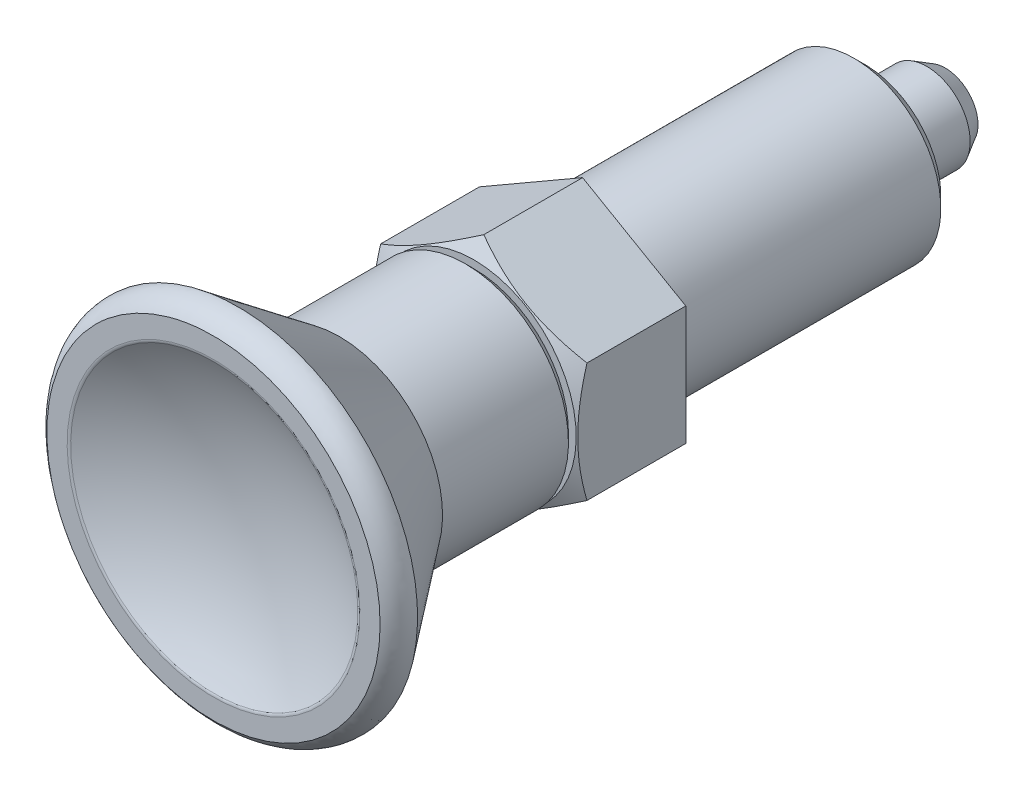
ISO-10303-21;
HEADER;
FILE_DESCRIPTION(('STEP AP214'),'2;1');
FILE_NAME('part.step','',(''),(''),'','','');
FILE_SCHEMA(('AUTOMOTIVE_DESIGN { 1 0 10303 214 1 1 1 1 }'));
ENDSEC;
DATA;
#1=APPLICATION_CONTEXT('core data for automotive mechanical design processes');
#2=APPLICATION_PROTOCOL_DEFINITION('international standard','automotive_design',2000,#1);
#3=PRODUCT_CONTEXT('',#1,'mechanical');
#4=PRODUCT('Part','Part','',(#3));
#5=PRODUCT_RELATED_PRODUCT_CATEGORY('part','',(#4));
#6=PRODUCT_DEFINITION_FORMATION('','',#4);
#7=PRODUCT_DEFINITION_CONTEXT('part definition',#1,'design');
#8=PRODUCT_DEFINITION('design','',#6,#7);
#9=PRODUCT_DEFINITION_SHAPE('','',#8);
#10=(LENGTH_UNIT() NAMED_UNIT(*) SI_UNIT(.MILLI.,.METRE.));
#11=(NAMED_UNIT(*) PLANE_ANGLE_UNIT() SI_UNIT($,.RADIAN.));
#12=(NAMED_UNIT(*) SI_UNIT($,.STERADIAN.) SOLID_ANGLE_UNIT());
#13=UNCERTAINTY_MEASURE_WITH_UNIT(LENGTH_MEASURE(1.E-05),#10,'distance_accuracy_value','');
#14=(GEOMETRIC_REPRESENTATION_CONTEXT(3) GLOBAL_UNCERTAINTY_ASSIGNED_CONTEXT((#13)) GLOBAL_UNIT_ASSIGNED_CONTEXT((#10,
#11,#12)) REPRESENTATION_CONTEXT('',''));
#15=CARTESIAN_POINT('',(0.,0.,0.));
#16=DIRECTION('',(0.,0.,1.));
#17=DIRECTION('',(1.,0.,0.));
#18=AXIS2_PLACEMENT_3D('',#15,#16,#17);
#19=CARTESIAN_POINT('',(0.,0.,-26.));
#20=DIRECTION('',(0.,0.,1.));
#21=DIRECTION('',(0.5,0.866025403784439,0.));
#22=AXIS2_PLACEMENT_3D('',#19,#20,#21);
#23=CONICAL_SURFACE('',#22,7.,0.785398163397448);
#24=CARTESIAN_POINT('',(0.,0.,-25.));
#25=DIRECTION('',(0.,0.,-1.));
#26=DIRECTION('',(0.5,0.866025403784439,0.));
#27=AXIS2_PLACEMENT_3D('',#24,#25,#26);
#28=CIRCLE('',#27,8.);
#29=CARTESIAN_POINT('',(4.00000000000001,6.9282032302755,-25.));
#30=VERTEX_POINT('',#29);
#31=EDGE_CURVE('E117',#30,#30,#28,.T.);
#32=ORIENTED_EDGE('',*,*,#31,.T.);
#33=EDGE_LOOP('',(#32));
#34=FACE_BOUND('',#33,.T.);
#35=CARTESIAN_POINT('',(0.,0.,-26.));
#36=DIRECTION('',(0.,0.,1.));
#37=DIRECTION('',(0.5,0.866025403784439,0.));
#38=AXIS2_PLACEMENT_3D('',#35,#36,#37);
#39=CIRCLE('',#38,7.);
#40=CARTESIAN_POINT('',(3.50000000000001,6.06217782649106,-26.));
#41=VERTEX_POINT('',#40);
#42=EDGE_CURVE('E121',#41,#41,#39,.T.);
#43=ORIENTED_EDGE('',*,*,#42,.T.);
#44=EDGE_LOOP('',(#43));
#45=FACE_BOUND('',#44,.T.);
#46=ADVANCED_FACE('F14',(#34,#45),#23,.T.);
#47=CARTESIAN_POINT('',(0.,0.,0.));
#48=DIRECTION('',(0.,0.,-1.));
#49=DIRECTION('',(0.5,0.866025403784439,0.));
#50=AXIS2_PLACEMENT_3D('',#47,#48,#49);
#51=CYLINDRICAL_SURFACE('',#50,8.);
#52=ORIENTED_EDGE('',*,*,#31,.F.);
#53=EDGE_LOOP('',(#52));
#54=FACE_BOUND('',#53,.T.);
#55=CARTESIAN_POINT('',(0.,0.,0.));
#56=DIRECTION('',(0.,0.,1.));
#57=DIRECTION('',(0.5,0.866025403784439,0.));
#58=AXIS2_PLACEMENT_3D('',#55,#56,#57);
#59=CIRCLE('',#58,8.);
#60=CARTESIAN_POINT('',(4.00000000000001,6.9282032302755,0.));
#61=VERTEX_POINT('',#60);
#62=EDGE_CURVE('E111',#61,#61,#59,.T.);
#63=ORIENTED_EDGE('',*,*,#62,.F.);
#64=EDGE_LOOP('',(#63));
#65=FACE_BOUND('',#64,.T.);
#66=ADVANCED_FACE('F178',(#54,#65),#51,.T.);
#67=CARTESIAN_POINT('',(-4.63022135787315,17.2802213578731,0.));
#68=DIRECTION('',(0.,0.,-1.));
#69=DIRECTION('',(0.866025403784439,-0.5,0.));
#70=AXIS2_PLACEMENT_3D('',#67,#68,#69);
#71=PLANE('',#70);
#72=DIRECTION('',(-0.866025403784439,0.5,0.));
#73=VECTOR('',#72,1.);
#74=CARTESIAN_POINT('',(0.,-10.9725,0.));
#75=LINE('',#74,#73);
#76=CARTESIAN_POINT('',(0.,-10.9725,0.));
#77=VERTEX_POINT('',#76);
#78=CARTESIAN_POINT('',(-9.50246374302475,-5.48625,0.));
#79=VERTEX_POINT('',#78);
#80=EDGE_CURVE('E312',#77,#79,#75,.T.);
#81=ORIENTED_EDGE('',*,*,#80,.T.);
#82=DIRECTION('',(0.,1.,0.));
#83=VECTOR('',#82,1.);
#84=CARTESIAN_POINT('',(-9.50246374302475,-5.48625,0.));
#85=LINE('',#84,#83);
#86=CARTESIAN_POINT('',(-9.50246374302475,5.48625,0.));
#87=VERTEX_POINT('',#86);
#88=EDGE_CURVE('E318',#79,#87,#85,.T.);
#89=ORIENTED_EDGE('',*,*,#88,.T.);
#90=DIRECTION('',(0.866025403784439,0.5,0.));
#91=VECTOR('',#90,1.);
#92=CARTESIAN_POINT('',(-9.50246374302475,5.48625,0.));
#93=LINE('',#92,#91);
#94=CARTESIAN_POINT('',(0.,10.9725,0.));
#95=VERTEX_POINT('',#94);
#96=EDGE_CURVE('E81',#87,#95,#93,.T.);
#97=ORIENTED_EDGE('',*,*,#96,.T.);
#98=DIRECTION('',(0.866025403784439,-0.5,0.));
#99=VECTOR('',#98,1.);
#100=CARTESIAN_POINT('',(0.,10.9725,0.));
#101=LINE('',#100,#99);
#102=CARTESIAN_POINT('',(9.50246374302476,5.48625,0.));
#103=VERTEX_POINT('',#102);
#104=EDGE_CURVE('E86',#95,#103,#101,.T.);
#105=ORIENTED_EDGE('',*,*,#104,.T.);
#106=DIRECTION('',(0.,-1.,0.));
#107=VECTOR('',#106,1.);
#108=CARTESIAN_POINT('',(9.50246374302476,5.48625,0.));
#109=LINE('',#108,#107);
#110=CARTESIAN_POINT('',(9.50246374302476,-5.48625,0.));
#111=VERTEX_POINT('',#110);
#112=EDGE_CURVE('E90',#103,#111,#109,.T.);
#113=ORIENTED_EDGE('',*,*,#112,.T.);
#114=DIRECTION('',(-0.866025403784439,-0.5,0.));
#115=VECTOR('',#114,1.);
#116=CARTESIAN_POINT('',(9.50246374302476,-5.48625,0.));
#117=LINE('',#116,#115);
#118=EDGE_CURVE('E106',#111,#77,#117,.T.);
#119=ORIENTED_EDGE('',*,*,#118,.T.);
#120=EDGE_LOOP('',(#81,#89,#97,#105,#113,#119));
#121=FACE_BOUND('',#120,.T.);
#122=ORIENTED_EDGE('',*,*,#62,.T.);
#123=EDGE_LOOP('',(#122));
#124=FACE_BOUND('',#123,.T.);
#125=ADVANCED_FACE('F87',(#121,#124),#71,.T.);
#126=CARTESIAN_POINT('',(-9.50246374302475,-5.48625,10.));
#127=DIRECTION('',(0.5,0.866025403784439,0.));
#128=DIRECTION('',(0.866025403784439,-0.5,0.));
#129=AXIS2_PLACEMENT_3D('',#126,#127,#128);
#130=PLANE('',#129);
#131=DIRECTION('',(0.,0.,-1.));
#132=VECTOR('',#131,1.);
#133=CARTESIAN_POINT('',(-9.50246374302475,-5.48625,9.1));
#134=LINE('',#133,#132);
#135=CARTESIAN_POINT('',(-9.50246374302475,-5.48625,9.1));
#136=VERTEX_POINT('',#135);
#137=EDGE_CURVE('E301',#136,#79,#134,.T.);
#138=ORIENTED_EDGE('',*,*,#137,.T.);
#139=ORIENTED_EDGE('',*,*,#80,.F.);
#140=DIRECTION('',(0.,0.,1.));
#141=VECTOR('',#140,1.);
#142=CARTESIAN_POINT('',(0.,-10.9725,0.));
#143=LINE('',#142,#141);
#144=CARTESIAN_POINT('',(0.,-10.9725,9.1));
#145=VERTEX_POINT('',#144);
#146=EDGE_CURVE('E302',#77,#145,#143,.T.);
#147=ORIENTED_EDGE('',*,*,#146,.T.);
#148=CARTESIAN_POINT('',(-9.50246374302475,-5.48625,9.1));
#149=CARTESIAN_POINT('',(-4.75123187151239,-8.22937500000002,10.6837439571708));
#150=CARTESIAN_POINT('',(0.,-10.9725,9.1));
#151=(BOUNDED_CURVE() B_SPLINE_CURVE(2,(#148,#149,#150),.UNSPECIFIED.,.F.,
.F.) B_SPLINE_CURVE_WITH_KNOTS((3,3),(0.,1.),
.UNSPECIFIED.) CURVE() GEOMETRIC_REPRESENTATION_ITEM() RATIONAL_B_SPLINE_CURVE((1.,
1.15470053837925,1.)) REPRESENTATION_ITEM(''));
#152=EDGE_CURVE('E283',#136,#145,#151,.T.);
#153=ORIENTED_EDGE('',*,*,#152,.F.);
#154=EDGE_LOOP('',(#138,#139,#147,#153));
#155=FACE_BOUND('',#154,.T.);
#156=ADVANCED_FACE('F401',(#155),#130,.F.);
#157=CARTESIAN_POINT('',(-9.50246374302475,5.48625,10.));
#158=DIRECTION('',(1.,0.,0.));
#159=DIRECTION('',(0.,-1.,0.));
#160=AXIS2_PLACEMENT_3D('',#157,#158,#159);
#161=PLANE('',#160);
#162=DIRECTION('',(0.,0.,-1.));
#163=VECTOR('',#162,1.);
#164=CARTESIAN_POINT('',(-9.50246374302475,5.48625,9.1));
#165=LINE('',#164,#163);
#166=CARTESIAN_POINT('',(-9.50246374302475,5.48625,9.1));
#167=VERTEX_POINT('',#166);
#168=EDGE_CURVE('E308',#167,#87,#165,.T.);
#169=ORIENTED_EDGE('',*,*,#168,.T.);
#170=ORIENTED_EDGE('',*,*,#88,.F.);
#171=ORIENTED_EDGE('',*,*,#137,.F.);
#172=CARTESIAN_POINT('',(-9.50246374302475,5.48625,9.1));
#173=CARTESIAN_POINT('',(-9.50246374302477,0.,10.6837439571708));
#174=CARTESIAN_POINT('',(-9.50246374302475,-5.48625,9.1));
#175=(BOUNDED_CURVE() B_SPLINE_CURVE(2,(#172,#173,#174),.UNSPECIFIED.,.F.,
.F.) B_SPLINE_CURVE_WITH_KNOTS((3,3),(0.,1.),
.UNSPECIFIED.) CURVE() GEOMETRIC_REPRESENTATION_ITEM() RATIONAL_B_SPLINE_CURVE((1.,
1.15470053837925,1.)) REPRESENTATION_ITEM(''));
#176=EDGE_CURVE('E274',#167,#136,#175,.T.);
#177=ORIENTED_EDGE('',*,*,#176,.F.);
#178=EDGE_LOOP('',(#169,#170,#171,#177));
#179=FACE_BOUND('',#178,.T.);
#180=ADVANCED_FACE('F413',(#179),#161,.F.);
#181=CARTESIAN_POINT('',(0.,10.9725,10.));
#182=DIRECTION('',(0.5,-0.866025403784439,0.));
#183=DIRECTION('',(-0.866025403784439,-0.5,0.));
#184=AXIS2_PLACEMENT_3D('',#181,#182,#183);
#185=PLANE('',#184);
#186=DIRECTION('',(0.,0.,-1.));
#187=VECTOR('',#186,1.);
#188=CARTESIAN_POINT('',(0.,10.9725,9.1));
#189=LINE('',#188,#187);
#190=CARTESIAN_POINT('',(0.,10.9725,9.1));
#191=VERTEX_POINT('',#190);
#192=EDGE_CURVE('E99',#191,#95,#189,.T.);
#193=ORIENTED_EDGE('',*,*,#192,.T.);
#194=ORIENTED_EDGE('',*,*,#96,.F.);
#195=ORIENTED_EDGE('',*,*,#168,.F.);
#196=CARTESIAN_POINT('',(0.,10.9725,9.1));
#197=CARTESIAN_POINT('',(-4.75123187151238,8.229375,10.6837439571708));
#198=CARTESIAN_POINT('',(-9.50246374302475,5.48625,9.1));
#199=(BOUNDED_CURVE() B_SPLINE_CURVE(2,(#196,#197,#198),.UNSPECIFIED.,.F.,
.F.) B_SPLINE_CURVE_WITH_KNOTS((3,3),(0.,1.),
.UNSPECIFIED.) CURVE() GEOMETRIC_REPRESENTATION_ITEM() RATIONAL_B_SPLINE_CURVE((1.,
1.15470053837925,1.)) REPRESENTATION_ITEM(''));
#200=EDGE_CURVE('E265',#191,#167,#199,.T.);
#201=ORIENTED_EDGE('',*,*,#200,.F.);
#202=EDGE_LOOP('',(#193,#194,#195,#201));
#203=FACE_BOUND('',#202,.T.);
#204=ADVANCED_FACE('F425',(#203),#185,.F.);
#205=CARTESIAN_POINT('',(9.50246374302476,5.48625,10.));
#206=DIRECTION('',(-0.5,-0.866025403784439,0.));
#207=DIRECTION('',(-0.866025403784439,0.5,0.));
#208=AXIS2_PLACEMENT_3D('',#205,#206,#207);
#209=PLANE('',#208);
#210=DIRECTION('',(0.,0.,-1.));
#211=VECTOR('',#210,1.);
#212=CARTESIAN_POINT('',(9.50246374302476,5.48625,9.1));
#213=LINE('',#212,#211);
#214=CARTESIAN_POINT('',(9.50246374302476,5.48625,9.1));
#215=VERTEX_POINT('',#214);
#216=EDGE_CURVE('E94',#215,#103,#213,.T.);
#217=ORIENTED_EDGE('',*,*,#216,.T.);
#218=ORIENTED_EDGE('',*,*,#104,.F.);
#219=ORIENTED_EDGE('',*,*,#192,.F.);
#220=CARTESIAN_POINT('',(9.50246374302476,5.48625,9.1));
#221=CARTESIAN_POINT('',(4.75123187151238,8.22937500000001,10.6837439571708));
#222=CARTESIAN_POINT('',(0.,10.9725,9.1));
#223=(BOUNDED_CURVE() B_SPLINE_CURVE(2,(#220,#221,#222),.UNSPECIFIED.,.F.,
.F.) B_SPLINE_CURVE_WITH_KNOTS((3,3),(0.,1.),
.UNSPECIFIED.) CURVE() GEOMETRIC_REPRESENTATION_ITEM() RATIONAL_B_SPLINE_CURVE((1.,
1.15470053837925,1.)) REPRESENTATION_ITEM(''));
#224=EDGE_CURVE('E39',#215,#191,#223,.T.);
#225=ORIENTED_EDGE('',*,*,#224,.F.);
#226=EDGE_LOOP('',(#217,#218,#219,#225));
#227=FACE_BOUND('',#226,.T.);
#228=ADVANCED_FACE('F95',(#227),#209,.F.);
#229=CARTESIAN_POINT('',(9.50246374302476,-5.48625,10.));
#230=DIRECTION('',(-1.,0.,0.));
#231=DIRECTION('',(0.,1.,0.));
#232=AXIS2_PLACEMENT_3D('',#229,#230,#231);
#233=PLANE('',#232);
#234=DIRECTION('',(0.,0.,-1.));
#235=VECTOR('',#234,1.);
#236=CARTESIAN_POINT('',(9.50246374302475,-5.48625,9.1));
#237=LINE('',#236,#235);
#238=CARTESIAN_POINT('',(9.50246374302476,-5.48625,9.1));
#239=VERTEX_POINT('',#238);
#240=EDGE_CURVE('E100',#239,#111,#237,.T.);
#241=ORIENTED_EDGE('',*,*,#240,.T.);
#242=ORIENTED_EDGE('',*,*,#112,.F.);
#243=ORIENTED_EDGE('',*,*,#216,.F.);
#244=CARTESIAN_POINT('',(9.50246374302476,-5.48625,9.1));
#245=CARTESIAN_POINT('',(9.50246374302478,0.,10.6837439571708));
#246=CARTESIAN_POINT('',(9.50246374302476,5.48625,9.1));
#247=(BOUNDED_CURVE() B_SPLINE_CURVE(2,(#244,#245,#246),.UNSPECIFIED.,.F.,
.F.) B_SPLINE_CURVE_WITH_KNOTS((3,3),(0.,1.),
.UNSPECIFIED.) CURVE() GEOMETRIC_REPRESENTATION_ITEM() RATIONAL_B_SPLINE_CURVE((1.,
1.15470053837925,1.)) REPRESENTATION_ITEM(''));
#248=EDGE_CURVE('E253',#239,#215,#247,.T.);
#249=ORIENTED_EDGE('',*,*,#248,.F.);
#250=EDGE_LOOP('',(#241,#242,#243,#249));
#251=FACE_BOUND('',#250,.T.);
#252=ADVANCED_FACE('F103',(#251),#233,.F.);
#253=CARTESIAN_POINT('',(0.,-10.9725,10.));
#254=DIRECTION('',(-0.5,0.866025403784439,0.));
#255=DIRECTION('',(0.866025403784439,0.5,0.));
#256=AXIS2_PLACEMENT_3D('',#253,#254,#255);
#257=PLANE('',#256);
#258=ORIENTED_EDGE('',*,*,#146,.F.);
#259=ORIENTED_EDGE('',*,*,#118,.F.);
#260=ORIENTED_EDGE('',*,*,#240,.F.);
#261=CARTESIAN_POINT('',(0.,-10.9725,9.1));
#262=CARTESIAN_POINT('',(4.75123187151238,-8.229375,10.6837439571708));
#263=CARTESIAN_POINT('',(9.50246374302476,-5.48625,9.1));
#264=(BOUNDED_CURVE() B_SPLINE_CURVE(2,(#261,#262,#263),.UNSPECIFIED.,.F.,
.F.) B_SPLINE_CURVE_WITH_KNOTS((3,3),(0.,1.),
.UNSPECIFIED.) CURVE() GEOMETRIC_REPRESENTATION_ITEM() RATIONAL_B_SPLINE_CURVE((1.,
1.15470053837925,1.)) REPRESENTATION_ITEM(''));
#265=EDGE_CURVE('E292',#145,#239,#264,.T.);
#266=ORIENTED_EDGE('',*,*,#265,.F.);
#267=EDGE_LOOP('',(#258,#259,#260,#266));
#268=FACE_BOUND('',#267,.T.);
#269=ADVANCED_FACE('F402',(#268),#257,.F.);
#270=CARTESIAN_POINT('',(0.,0.,10.));
#271=DIRECTION('',(0.,0.,-1.));
#272=DIRECTION('',(0.866025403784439,-0.5,0.));
#273=AXIS2_PLACEMENT_3D('',#270,#271,#272);
#274=CONICAL_SURFACE('',#273,9.41365427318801,1.0471975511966);
#275=ORIENTED_EDGE('',*,*,#248,.T.);
#276=ORIENTED_EDGE('',*,*,#224,.T.);
#277=ORIENTED_EDGE('',*,*,#200,.T.);
#278=ORIENTED_EDGE('',*,*,#176,.T.);
#279=ORIENTED_EDGE('',*,*,#152,.T.);
#280=ORIENTED_EDGE('',*,*,#265,.T.);
#281=EDGE_LOOP('',(#275,#276,#277,#278,#279,#280));
#282=FACE_BOUND('',#281,.T.);
#283=CARTESIAN_POINT('',(0.,0.,10.));
#284=DIRECTION('',(0.,0.,1.));
#285=DIRECTION('',(0.866025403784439,-0.5,0.));
#286=AXIS2_PLACEMENT_3D('',#283,#284,#285);
#287=CIRCLE('',#286,9.41365427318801);
#288=CARTESIAN_POINT('',(8.15246374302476,-4.70682713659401,10.));
#289=VERTEX_POINT('',#288);
#290=EDGE_CURVE('E128',#289,#289,#287,.T.);
#291=ORIENTED_EDGE('',*,*,#290,.F.);
#292=EDGE_LOOP('',(#291));
#293=FACE_BOUND('',#292,.T.);
#294=ADVANCED_FACE('F459',(#282,#293),#274,.T.);
#295=CARTESIAN_POINT('',(-17.2802213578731,-4.63022135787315,10.));
#296=DIRECTION('',(0.,0.,1.));
#297=DIRECTION('',(0.866025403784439,-0.5,0.));
#298=AXIS2_PLACEMENT_3D('',#295,#296,#297);
#299=PLANE('',#298);
#300=CARTESIAN_POINT('',(0.,0.,10.));
#301=DIRECTION('',(0.,0.,1.));
#302=DIRECTION('',(-0.5,-0.866025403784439,0.));
#303=AXIS2_PLACEMENT_3D('',#300,#301,#302);
#304=CIRCLE('',#303,8.7);
#305=CARTESIAN_POINT('',(-4.34999999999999,-7.53442101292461,10.));
#306=VERTEX_POINT('',#305);
#307=EDGE_CURVE('E126',#306,#306,#304,.T.);
#308=ORIENTED_EDGE('',*,*,#307,.F.);
#309=EDGE_LOOP('',(#308));
#310=FACE_BOUND('',#309,.T.);
#311=ORIENTED_EDGE('',*,*,#290,.T.);
#312=EDGE_LOOP('',(#311));
#313=FACE_BOUND('',#312,.T.);
#314=ADVANCED_FACE('F479',(#310,#313),#299,.T.);
#315=CARTESIAN_POINT('',(0.,0.,10.));
#316=DIRECTION('',(0.,0.,1.));
#317=DIRECTION('',(0.866025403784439,-0.5,0.));
#318=AXIS2_PLACEMENT_3D('',#315,#316,#317);
#319=CONICAL_SURFACE('',#318,8.7,0.785398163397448);
#320=CARTESIAN_POINT('',(0.,0.,10.8));
#321=DIRECTION('',(0.,0.,1.));
#322=DIRECTION('',(0.866025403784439,-0.5,0.));
#323=AXIS2_PLACEMENT_3D('',#320,#321,#322);
#324=CIRCLE('',#323,9.5);
#325=CARTESIAN_POINT('',(8.22724133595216,-4.75,10.8));
#326=VERTEX_POINT('',#325);
#327=EDGE_CURVE('E125',#326,#326,#324,.T.);
#328=ORIENTED_EDGE('',*,*,#327,.F.);
#329=EDGE_LOOP('',(#328));
#330=FACE_BOUND('',#329,.T.);
#331=ORIENTED_EDGE('',*,*,#307,.T.);
#332=EDGE_LOOP('',(#331));
#333=FACE_BOUND('',#332,.T.);
#334=ADVANCED_FACE('F491',(#330,#333),#319,.T.);
#335=CARTESIAN_POINT('',(0.,0.,22.4));
#336=DIRECTION('',(0.,0.,-1.));
#337=DIRECTION('',(0.866025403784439,-0.5,0.));
#338=AXIS2_PLACEMENT_3D('',#335,#336,#337);
#339=CYLINDRICAL_SURFACE('',#338,9.5);
#340=ORIENTED_EDGE('',*,*,#327,.T.);
#341=EDGE_LOOP('',(#340));
#342=FACE_BOUND('',#341,.T.);
#343=CARTESIAN_POINT('',(0.,0.,22.4));
#344=DIRECTION('',(0.,0.,-1.));
#345=DIRECTION('',(0.866025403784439,-0.5,0.));
#346=AXIS2_PLACEMENT_3D('',#343,#344,#345);
#347=CIRCLE('',#346,9.5);
#348=CARTESIAN_POINT('',(8.22724133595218,-4.74999999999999,22.4));
#349=VERTEX_POINT('',#348);
#350=EDGE_CURVE('E357',#349,#349,#347,.T.);
#351=ORIENTED_EDGE('',*,*,#350,.T.);
#352=EDGE_LOOP('',(#351));
#353=FACE_BOUND('',#352,.T.);
#354=ADVANCED_FACE('F504',(#342,#353),#339,.T.);
#355=CARTESIAN_POINT('',(0.,0.,22.4));
#356=DIRECTION('',(0.,0.,1.));
#357=DIRECTION('',(0.866025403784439,-0.5,0.));
#358=AXIS2_PLACEMENT_3D('',#355,#356,#357);
#359=CONICAL_SURFACE('',#358,9.5,0.645219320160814);
#360=CARTESIAN_POINT('',(0.,0.,31.7));
#361=DIRECTION('',(0.,0.,1.));
#362=DIRECTION('',(0.866025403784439,-0.5,0.));
#363=AXIS2_PLACEMENT_3D('',#360,#361,#362);
#364=CIRCLE('',#363,16.5);
#365=CARTESIAN_POINT('',(14.2894191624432,-8.25,31.7));
#366=VERTEX_POINT('',#365);
#367=EDGE_CURVE('E239',#366,#366,#364,.T.);
#368=ORIENTED_EDGE('',*,*,#367,.F.);
#369=EDGE_LOOP('',(#368));
#370=FACE_BOUND('',#369,.T.);
#371=ORIENTED_EDGE('',*,*,#350,.F.);
#372=EDGE_LOOP('',(#371));
#373=FACE_BOUND('',#372,.T.);
#374=ADVANCED_FACE('F517',(#370,#373),#359,.T.);
#375=CARTESIAN_POINT('',(13.2934899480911,-7.675,34.));
#376=CARTESIAN_POINT('',(14.389578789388,-8.30782718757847,33.1898669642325));
#377=CARTESIAN_POINT('',(14.2894191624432,-8.25,31.7));
#378=CARTESIAN_POINT('',(0.,-30.7,34.));
#379=CARTESIAN_POINT('',(0.,-33.2313087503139,33.1898669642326));
#380=CARTESIAN_POINT('',(0.,-33.,31.7));
#381=CARTESIAN_POINT('',(-13.2934899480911,-7.675,34.));
#382=CARTESIAN_POINT('',(-14.389578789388,-8.30782718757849,33.1898669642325));
#383=CARTESIAN_POINT('',(-14.2894191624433,-8.25,31.7));
#384=CARTESIAN_POINT('',(-26.5869798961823,15.35,34.));
#385=CARTESIAN_POINT('',(-28.7791575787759,16.6156543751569,33.1898669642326));
#386=CARTESIAN_POINT('',(-28.5788383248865,16.5,31.7));
#387=CARTESIAN_POINT('',(0.,15.35,34.));
#388=CARTESIAN_POINT('',(0.,16.615654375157,33.1898669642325));
#389=CARTESIAN_POINT('',(0.,16.5,31.7));
#390=CARTESIAN_POINT('',(26.5869798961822,15.35,34.));
#391=CARTESIAN_POINT('',(28.779157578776,16.615654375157,33.1898669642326));
#392=CARTESIAN_POINT('',(28.5788383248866,16.5,31.7));
#393=CARTESIAN_POINT('',(13.2934899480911,-7.675,34.));
#394=CARTESIAN_POINT('',(14.389578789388,-8.30782718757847,33.1898669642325));
#395=CARTESIAN_POINT('',(14.2894191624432,-8.25,31.7));
#396=(BOUNDED_SURFACE() B_SPLINE_SURFACE(2,2,((#375,#376,#377),(#378,#379,#380),(#381,#382,
#383),(#384,#385,#386),(#387,#388,#389),(#390,#391,#392),(#393,#394,#395)),.UNSPECIFIED.,.T.,
.F.,.F.) B_SPLINE_SURFACE_WITH_KNOTS((3,2,2,3),(3,3),(0.,18.7749492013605,37.5498984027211,
56.3248476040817),(0.,1.),
.UNSPECIFIED.) GEOMETRIC_REPRESENTATION_ITEM() RATIONAL_B_SPLINE_SURFACE(((1.,0.857079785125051,
1.),(0.5,0.428539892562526,0.5),(1.,0.857079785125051,1.),(0.5,0.428539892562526,0.5),(1.,
0.857079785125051,1.),(0.5,0.428539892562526,0.5),(1.,0.857079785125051,1.))) REPRESENTATION_ITEM('') SURFACE());
#397=CARTESIAN_POINT('',(0.,0.,34.));
#398=DIRECTION('',(0.,0.,-1.));
#399=DIRECTION('',(0.866025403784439,-0.5,0.));
#400=AXIS2_PLACEMENT_3D('',#397,#398,#399);
#401=CIRCLE('',#400,15.35);
#402=CARTESIAN_POINT('',(13.2934899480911,-7.675,34.));
#403=VERTEX_POINT('',#402);
#404=EDGE_CURVE('E245',#403,#403,#401,.T.);
#405=CARTESIAN_POINT('',(13.2934899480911,-7.675,34.));
#406=CARTESIAN_POINT('',(13.298388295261,-7.67782806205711,33.9963795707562));
#407=CARTESIAN_POINT('',(13.3032741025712,-7.68064888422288,33.992736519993));
#408=CARTESIAN_POINT('',(13.3130310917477,-7.68628208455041,33.9853973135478));
#409=CARTESIAN_POINT('',(13.3179022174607,-7.68909443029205,33.9817010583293));
#410=CARTESIAN_POINT('',(13.3276292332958,-7.69471032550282,33.9742554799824));
#411=CARTESIAN_POINT('',(13.3324850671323,-7.69751384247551,33.9705060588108));
#412=CARTESIAN_POINT('',(13.3421808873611,-7.70311172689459,33.9629541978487));
#413=CARTESIAN_POINT('',(13.3470208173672,-7.70590606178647,33.9591516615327));
#414=CARTESIAN_POINT('',(13.3566842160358,-7.7114852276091,33.9514936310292));
#415=CARTESIAN_POINT('',(13.3615076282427,-7.71427002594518,33.9476380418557));
#416=CARTESIAN_POINT('',(13.3711373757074,-7.71982976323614,33.9398739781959));
#417=CARTESIAN_POINT('',(13.3759436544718,-7.72260466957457,33.9359654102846));
#418=CARTESIAN_POINT('',(13.3855385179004,-7.72814426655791,33.92809547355));
#419=CARTESIAN_POINT('',(13.3903270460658,-7.73090892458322,33.9241340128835));
#420=CARTESIAN_POINT('',(13.3998857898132,-7.73642766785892,33.9161583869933));
#421=CARTESIAN_POINT('',(13.4046559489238,-7.73918172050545,33.9121441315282));
#422=CARTESIAN_POINT('',(13.4141773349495,-7.74467889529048,33.9040630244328));
#423=CARTESIAN_POINT('',(13.4189285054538,-7.74742198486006,33.8999960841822));
#424=CARTESIAN_POINT('',(13.4284112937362,-7.75289687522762,33.8918097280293));
#425=CARTESIAN_POINT('',(13.4331428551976,-7.75562864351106,33.8876902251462));
#426=CARTESIAN_POINT('',(13.4425858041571,-7.76108053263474,33.8793988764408));
#427=CARTESIAN_POINT('',(13.4472971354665,-7.76380062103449,33.8752269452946));
#428=CARTESIAN_POINT('',(13.4566990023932,-7.76922879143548,33.8668308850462));
#429=CARTESIAN_POINT('',(13.4613894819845,-7.77193684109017,33.8626066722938));
#430=CARTESIAN_POINT('',(13.4707490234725,-7.77734057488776,33.8541062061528));
#431=CARTESIAN_POINT('',(13.4754180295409,-7.78003622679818,33.8498298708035));
#432=CARTESIAN_POINT('',(13.4847340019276,-7.78541480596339,33.8412253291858));
#433=CARTESIAN_POINT('',(13.4893809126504,-7.7880977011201,33.8368970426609));
#434=CARTESIAN_POINT('',(13.4986520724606,-7.79345040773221,33.8281887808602));
#435=CARTESIAN_POINT('',(13.5032762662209,-7.79612018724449,33.8238087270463));
#436=CARTESIAN_POINT('',(13.5125013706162,-7.80144630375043,33.8149971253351));
#437=CARTESIAN_POINT('',(13.5171022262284,-7.80410260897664,33.810565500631));
#438=CARTESIAN_POINT('',(13.526280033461,-7.80940141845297,33.8016509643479));
#439=CARTESIAN_POINT('',(13.530856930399,-7.81204389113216,33.7971679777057));
#440=CARTESIAN_POINT('',(13.5399862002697,-7.8173146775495,33.7881509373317));
#441=CARTESIAN_POINT('',(13.5445385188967,-7.81994295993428,33.783616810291));
#442=CARTESIAN_POINT('',(13.5536180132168,-7.82518500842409,33.7744977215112));
#443=CARTESIAN_POINT('',(13.5581451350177,-7.82779874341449,33.7699126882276));
#444=CARTESIAN_POINT('',(13.5671736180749,-7.83301134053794,33.7606920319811));
#445=CARTESIAN_POINT('',(13.5716749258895,-7.83561017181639,33.7560563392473));
#446=CARTESIAN_POINT('',(13.5806511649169,-7.84079260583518,33.7467346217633));
#447=CARTESIAN_POINT('',(13.5851260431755,-7.84337617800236,33.742048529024));
#448=CARTESIAN_POINT('',(13.5940488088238,-7.84852773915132,33.732626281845));
#449=CARTESIAN_POINT('',(13.5984966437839,-7.85109569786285,33.7278900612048));
#450=CARTESIAN_POINT('',(13.6073647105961,-7.85621567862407,33.7183678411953));
#451=CARTESIAN_POINT('',(13.6117848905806,-7.85876767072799,33.71358177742));
#452=CARTESIAN_POINT('',(13.6205970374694,-7.86385536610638,33.7039601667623));
#453=CARTESIAN_POINT('',(13.6249889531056,-7.86639103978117,33.6991245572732));
#454=CARTESIAN_POINT('',(13.6337439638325,-7.87144574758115,33.689404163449));
#455=CARTESIAN_POINT('',(13.6381070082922,-7.8739647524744,33.6845193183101));
#456=CARTESIAN_POINT('',(13.6468036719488,-7.87898577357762,33.6747007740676));
#457=CARTESIAN_POINT('',(13.6511372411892,-7.88148776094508,33.6697670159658));
#458=CARTESIAN_POINT('',(13.6597743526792,-7.8864743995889,33.6598509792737));
#459=CARTESIAN_POINT('',(13.6640778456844,-7.88895902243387,33.6548686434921));
#460=CARTESIAN_POINT('',(13.6726542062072,-7.89391058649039,33.6448557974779));
#461=CARTESIAN_POINT('',(13.67692702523,-7.89637749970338,33.6398252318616));
#462=CARTESIAN_POINT('',(13.6854414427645,-7.90129330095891,33.6297162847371));
#463=CARTESIAN_POINT('',(13.6896829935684,-7.90374216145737,33.6246378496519));
#464=CARTESIAN_POINT('',(13.6981342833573,-7.90862151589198,33.6144335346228));
#465=CARTESIAN_POINT('',(13.702343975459,-7.91105198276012,33.6093076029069));
#466=CARTESIAN_POINT('',(13.7107309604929,-7.91589421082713,33.5990086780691));
#467=CARTESIAN_POINT('',(13.7149082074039,-7.91830594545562,33.593835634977));
#468=CARTESIAN_POINT('',(13.723229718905,-7.92311037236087,33.5834428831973));
#469=CARTESIAN_POINT('',(13.7273739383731,-7.92550303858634,33.5782231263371));
#470=CARTESIAN_POINT('',(13.7356288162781,-7.93026899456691,33.5677373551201));
#471=CARTESIAN_POINT('',(13.7397394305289,-7.93264225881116,33.5624712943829));
#472=CARTESIAN_POINT('',(13.7479265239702,-7.93736907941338,33.5518933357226));
#473=CARTESIAN_POINT('',(13.7520029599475,-7.9397226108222,33.5465813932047));
#474=CARTESIAN_POINT('',(13.7601211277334,-7.94440963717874,33.535912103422));
#475=CARTESIAN_POINT('',(13.7641628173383,-7.94674310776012,33.5305547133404));
#476=CARTESIAN_POINT('',(13.7722109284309,-7.95138968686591,33.5197949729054));
#477=CARTESIAN_POINT('',(13.7762173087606,-7.95370277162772,33.5143925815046));
#478=CARTESIAN_POINT('',(13.7841942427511,-7.95830825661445,33.5035432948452));
#479=CARTESIAN_POINT('',(13.7881647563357,-7.96060063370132,33.4980963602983));
#480=CARTESIAN_POINT('',(13.7960694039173,-7.96516438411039,33.4871584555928));
#481=CARTESIAN_POINT('',(13.8000034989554,-7.96743573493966,33.4816674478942));
#482=CARTESIAN_POINT('',(13.8078347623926,-7.97195711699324,33.4706418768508));
#483=CARTESIAN_POINT('',(13.8117318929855,-7.97420712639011,33.4651072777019));
#484=CARTESIAN_POINT('',(13.8194886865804,-7.97868551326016,33.4539950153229));
#485=CARTESIAN_POINT('',(13.8233483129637,-7.98091386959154,33.448417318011));
#486=CARTESIAN_POINT('',(13.8310295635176,-7.98534864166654,33.4372193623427));
#487=CARTESIAN_POINT('',(13.8348511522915,-7.9875550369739,33.4315990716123));
#488=CARTESIAN_POINT('',(13.8424557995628,-7.99194558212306,33.4203164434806));
#489=CARTESIAN_POINT('',(13.8462388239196,-7.9941297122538,33.4146540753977));
#490=CARTESIAN_POINT('',(13.8537658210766,-7.99847542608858,33.4032878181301));
#491=CARTESIAN_POINT('',(13.8575097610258,-8.0006369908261,33.3975838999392));
#492=CARTESIAN_POINT('',(13.8649580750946,-8.00493727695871,33.3861350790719));
#493=CARTESIAN_POINT('',(13.8686624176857,-8.00707598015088,33.3803901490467));
#494=CARTESIAN_POINT('',(13.8760310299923,-8.01133025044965,33.3688598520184));
#495=CARTESIAN_POINT('',(13.8796952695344,-8.01344580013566,33.3630744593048));
#496=CARTESIAN_POINT('',(13.8869831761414,-8.01765347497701,33.3514637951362));
#497=CARTESIAN_POINT('',(13.8906068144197,-8.01974558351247,33.3456384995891));
#498=CARTESIAN_POINT('',(13.8978130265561,-8.02390609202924,33.3339485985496));
#499=CARTESIAN_POINT('',(13.9013955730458,-8.02597447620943,33.3280839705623));
#500=CARTESIAN_POINT('',(13.9085191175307,-8.03008725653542,33.3163159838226));
#501=CARTESIAN_POINT('',(13.9120600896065,-8.03213163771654,33.3104126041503));
#502=CARTESIAN_POINT('',(13.919100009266,-8.03619613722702,33.2985677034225));
#503=CARTESIAN_POINT('',(13.9225989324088,-8.03821624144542,33.2926261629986));
#504=CARTESIAN_POINT('',(13.9295542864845,-8.04223191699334,33.2807055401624));
#505=CARTESIAN_POINT('',(13.9330106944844,-8.04422747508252,33.2747264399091));
#506=CARTESIAN_POINT('',(13.9398805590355,-8.04819379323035,33.2627313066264));
#507=CARTESIAN_POINT('',(13.9432939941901,-8.05016454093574,33.256715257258));
#508=CARTESIAN_POINT('',(13.9500774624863,-8.0540809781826,33.2446468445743));
#509=CARTESIAN_POINT('',(13.9534474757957,-8.05602665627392,33.2385944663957));
#510=CARTESIAN_POINT('',(13.9601436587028,-8.0598926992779,33.2264540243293));
#511=CARTESIAN_POINT('',(13.9634698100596,-8.0618130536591,33.2203659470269));
#512=CARTESIAN_POINT('',(13.9700778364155,-8.0656281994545,33.2081547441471));
#513=CARTESIAN_POINT('',(13.973359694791,-8.06752298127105,33.2020316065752));
#514=CARTESIAN_POINT('',(13.979878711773,-8.07128673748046,33.189750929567));
#515=CARTESIAN_POINT('',(13.9831158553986,-8.07315570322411,33.1835933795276));
#516=CARTESIAN_POINT('',(13.9895450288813,-8.07686758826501,33.1712445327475));
#517=CARTESIAN_POINT('',(13.9927370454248,-8.07871049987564,33.1650532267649));
#518=CARTESIAN_POINT('',(13.9990755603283,-8.08237004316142,33.1526375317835));
#519=CARTESIAN_POINT('',(14.0022220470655,-8.08418666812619,33.1464131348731));
#520=CARTESIAN_POINT('',(14.0084691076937,-8.08779341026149,33.1339319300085));
#521=CARTESIAN_POINT('',(14.0115696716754,-8.08958352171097,33.1276751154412));
#522=CARTESIAN_POINT('',(14.0177245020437,-8.09313701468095,33.1151297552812));
#523=CARTESIAN_POINT('',(14.0207787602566,-8.09490039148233,33.1088412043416));
#524=CARTESIAN_POINT('',(14.0268406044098,-8.09840019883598,33.0962330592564));
#525=CARTESIAN_POINT('',(14.0298481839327,-8.1001366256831,33.0899134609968));
#526=CARTESIAN_POINT('',(14.0358163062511,-8.1035823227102,33.0772439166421));
#527=CARTESIAN_POINT('',(14.0387768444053,-8.10529159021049,33.0708939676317));
#528=CARTESIAN_POINT('',(14.0446505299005,-8.10868276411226,33.0581644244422));
#529=CARTESIAN_POINT('',(14.0475636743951,-8.11036466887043,33.0517848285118));
#530=CARTESIAN_POINT('',(14.0533422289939,-8.11370091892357,33.038996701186));
#531=CARTESIAN_POINT('',(14.0562076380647,-8.11535526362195,33.032588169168));
#532=CARTESIAN_POINT('',(14.061890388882,-8.11863620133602,33.0197428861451));
#533=CARTESIAN_POINT('',(14.064707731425,-8.12026279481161,33.01330613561));
#534=CARTESIAN_POINT('',(14.0702940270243,-8.12348804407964,33.0004051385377));
#535=CARTESIAN_POINT('',(14.0730629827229,-8.12508670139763,32.993940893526));
#536=CARTESIAN_POINT('',(14.0785521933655,-8.12825589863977,32.9809856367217));
#537=CARTESIAN_POINT('',(14.0812724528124,-8.12982644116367,32.9744946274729));
#538=CARTESIAN_POINT('',(14.0866639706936,-8.13293923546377,32.9614865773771));
#539=CARTESIAN_POINT('',(14.0893352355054,-8.13448149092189,32.9549695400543));
#540=CARTESIAN_POINT('',(14.0946284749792,-8.137537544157,32.9419101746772));
#541=CARTESIAN_POINT('',(14.0972504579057,-8.1390513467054,32.9353678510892));
#542=CARTESIAN_POINT('',(14.102444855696,-8.14205033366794,32.9222586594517));
#543=CARTESIAN_POINT('',(14.1050172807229,-8.14353552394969,32.9156917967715));
#544=CARTESIAN_POINT('',(14.1101122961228,-8.14647713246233,32.9025342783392));
#545=CARTESIAN_POINT('',(14.112634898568,-8.14793355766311,32.89594362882));
#546=CARTESIAN_POINT('',(14.1176300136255,-8.15081748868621,32.8827392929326));
#547=CARTESIAN_POINT('',(14.1201025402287,-8.15224500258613,32.8761256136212));
#548=CARTESIAN_POINT('',(14.1249972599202,-8.15507097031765,32.8628759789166));
#549=CARTESIAN_POINT('',(14.1274194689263,-8.15646943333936,32.856240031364));
#550=CARTESIAN_POINT('',(14.1322133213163,-8.15923716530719,32.8429466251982));
#551=CARTESIAN_POINT('',(14.1345849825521,-8.16060644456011,32.8362891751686));
#552=CARTESIAN_POINT('',(14.13927751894,-8.16331568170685,32.8229535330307));
#553=CARTESIAN_POINT('',(14.1415984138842,-8.16465565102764,32.8162753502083));
#554=CARTESIAN_POINT('',(14.1461892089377,-8.16730614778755,32.8028990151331));
#555=CARTESIAN_POINT('',(14.1484591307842,-8.1686166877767,32.7962008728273));
#556=CARTESIAN_POINT('',(14.1529477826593,-8.17120821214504,32.7827853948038));
#557=CARTESIAN_POINT('',(14.155166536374,-8.17248921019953,32.7760680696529));
#558=CARTESIAN_POINT('',(14.1595526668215,-8.17502154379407,32.7626150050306));
#559=CARTESIAN_POINT('',(14.1617200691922,-8.17627289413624,32.7558792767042));
#560=CARTESIAN_POINT('',(14.1660033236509,-8.17874583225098,32.7423901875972));
#561=CARTESIAN_POINT('',(14.1681192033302,-8.17996743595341,32.7356368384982));
#562=CARTESIAN_POINT('',(14.1722992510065,-8.18238078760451,32.7221132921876));
#563=CARTESIAN_POINT('',(14.1743634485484,-8.18357255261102,32.7153431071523));
#564=CARTESIAN_POINT('',(14.1784399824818,-8.18592614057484,32.7017866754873));
#565=CARTESIAN_POINT('',(14.1804523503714,-8.18708798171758,32.6950004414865));
#566=CARTESIAN_POINT('',(14.1844250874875,-8.18938164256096,32.6814127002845));
#567=CARTESIAN_POINT('',(14.1863854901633,-8.19051348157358,32.6746112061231));
#568=CARTESIAN_POINT('',(14.1902541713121,-8.19274706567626,32.6609937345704));
#569=CARTESIAN_POINT('',(14.1921624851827,-8.19384883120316,32.6541777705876));
#570=CARTESIAN_POINT('',(14.1959268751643,-8.19602220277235,32.6405321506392));
#571=CARTESIAN_POINT('',(14.1977829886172,-8.19709383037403,32.6337025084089));
#572=CARTESIAN_POINT('',(14.2014428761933,-8.19920686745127,32.6200303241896));
#573=CARTESIAN_POINT('',(14.2032466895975,-8.20024829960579,32.6131877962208));
#574=CARTESIAN_POINT('',(14.2068018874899,-8.20230089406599,32.5994906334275));
#575=CARTESIAN_POINT('',(14.2085533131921,-8.20331208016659,32.5926360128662));
#576=CARTESIAN_POINT('',(14.2120036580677,-8.20530413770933,32.5789154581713));
#577=CARTESIAN_POINT('',(14.2137026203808,-8.20628503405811,32.5720495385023));
#578=CARTESIAN_POINT('',(14.2170479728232,-8.20821647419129,32.5583071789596));
#579=CARTESIAN_POINT('',(14.2186944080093,-8.2091670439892,32.5514307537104));
#580=CARTESIAN_POINT('',(14.2219346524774,-8.21103780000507,32.5376681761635));
#581=CARTESIAN_POINT('',(14.2235285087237,-8.21195801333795,32.5307820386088));
#582=CARTESIAN_POINT('',(14.2266635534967,-8.21376803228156,32.5170008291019));
#583=CARTESIAN_POINT('',(14.2282047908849,-8.21465786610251,32.5101057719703));
#584=CARTESIAN_POINT('',(14.231234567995,-8.21640710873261,32.4963075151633));
#585=CARTESIAN_POINT('',(14.232723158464,-8.21726654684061,32.4894043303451));
#586=CARTESIAN_POINT('',(14.2356476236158,-8.21895498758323,32.4755906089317));
#587=CARTESIAN_POINT('',(14.2370835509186,-8.21978402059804,32.4686800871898));
#588=CARTESIAN_POINT('',(14.2399026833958,-8.22141164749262,32.4548524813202));
#589=CARTESIAN_POINT('',(14.2412859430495,-8.22221027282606,32.447935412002));
#590=CARTESIAN_POINT('',(14.2439997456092,-8.22377708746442,32.4340954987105));
#591=CARTESIAN_POINT('',(14.2453303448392,-8.22454530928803,32.427172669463));
#592=CARTESIAN_POINT('',(14.2479388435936,-8.22605132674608,32.4133220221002));
#593=CARTESIAN_POINT('',(14.2492168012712,-8.22678915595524,32.4063942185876));
#594=CARTESIAN_POINT('',(14.2517200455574,-8.22823440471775,32.3925344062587));
#595=CARTESIAN_POINT('',(14.2529453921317,-8.22894185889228,32.385602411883));
#596=CARTESIAN_POINT('',(14.2553434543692,-8.2303263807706,32.3717349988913));
#597=CARTESIAN_POINT('',(14.2565162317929,-8.23100348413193,32.3647995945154));
#598=CARTESIAN_POINT('',(14.2588092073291,-8.23232733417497,32.3509261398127));
#599=CARTESIAN_POINT('',(14.2599294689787,-8.23297411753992,32.3439881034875));
#600=CARTESIAN_POINT('',(14.2621174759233,-8.23423736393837,32.3301101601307));
#601=CARTESIAN_POINT('',(14.2631852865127,-8.23485386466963,32.3231702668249));
#602=CARTESIAN_POINT('',(14.2652684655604,-8.23605658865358,32.3092893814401));
#603=CARTESIAN_POINT('',(14.2662839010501,-8.23664285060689,32.3023484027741));
#604=CARTESIAN_POINT('',(14.268262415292,-8.23778514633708,32.2884661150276));
#605=CARTESIAN_POINT('',(14.2692255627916,-8.23834121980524,32.2815248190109));
#606=CARTESIAN_POINT('',(14.2710995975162,-8.23942319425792,32.2676426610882));
#607=CARTESIAN_POINT('',(14.2720105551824,-8.23994913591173,32.2607018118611));
#608=CARTESIAN_POINT('',(14.2737803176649,-8.2409709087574,32.2468213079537));
#609=CARTESIAN_POINT('',(14.2746391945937,-8.24146678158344,32.2398816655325));
#610=CARTESIAN_POINT('',(14.2763049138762,-8.24242848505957,32.2260043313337));
#611=CARTESIAN_POINT('',(14.27711182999,-8.24289435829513,32.2190666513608));
#612=CARTESIAN_POINT('',(14.2786737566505,-8.243796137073,32.2051939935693));
#613=CARTESIAN_POINT('',(14.2794288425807,-8.24423208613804,32.1982590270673));
#614=CARTESIAN_POINT('',(14.2808872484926,-8.24507409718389,32.1843925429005));
#615=CARTESIAN_POINT('',(14.2815906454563,-8.24548020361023,32.1774610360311));
#616=CARTESIAN_POINT('',(14.2829458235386,-8.24626261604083,32.1636022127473));
#617=CARTESIAN_POINT('',(14.2835976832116,-8.24663896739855,32.1566749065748));
#618=CARTESIAN_POINT('',(14.2848499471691,-8.24736196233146,32.1428252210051));
#619=CARTESIAN_POINT('',(14.285450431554,-8.24770865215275,32.1359028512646));
#620=CARTESIAN_POINT('',(14.2866001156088,-8.24837242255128,32.1220637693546));
#621=CARTESIAN_POINT('',(14.2871493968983,-8.24868955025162,32.1151470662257));
#622=CARTESIAN_POINT('',(14.288196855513,-8.2492943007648,32.101320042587));
#623=CARTESIAN_POINT('',(14.2886951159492,-8.24958197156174,32.0944097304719));
#624=CARTESIAN_POINT('',(14.2896407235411,-8.25012791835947,32.0805962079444));
#625=CARTESIAN_POINT('',(14.2900881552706,-8.25038624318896,32.0736930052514));
#626=CARTESIAN_POINT('',(14.2909323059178,-8.25087361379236,32.0598944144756));
#627=CARTESIAN_POINT('',(14.2913291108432,-8.25110270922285,32.0529990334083));
#628=CARTESIAN_POINT('',(14.2920722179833,-8.25153174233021,32.0392167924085));
#629=CARTESIAN_POINT('',(14.2924186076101,-8.2517317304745,32.0323299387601));
#630=CARTESIAN_POINT('',(14.293061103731,-8.25210267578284,32.0185654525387));
#631=CARTESIAN_POINT('',(14.2933572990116,-8.25227368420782,32.0116878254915));
#632=CARTESIAN_POINT('',(14.2938996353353,-8.25258680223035,31.9979424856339));
#633=CARTESIAN_POINT('',(14.294145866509,-8.25272896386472,31.9910747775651));
#634=CARTESIAN_POINT('',(14.2945885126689,-8.25298452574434,31.9773499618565));
#635=CARTESIAN_POINT('',(14.2947850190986,-8.25309797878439,31.9704928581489));
#636=CARTESIAN_POINT('',(14.2951284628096,-8.2532962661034,31.9567899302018));
#637=CARTESIAN_POINT('',(14.2952754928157,-8.25338115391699,31.9499441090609));
#638=CARTESIAN_POINT('',(14.2955202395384,-8.25352245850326,31.9362644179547));
#639=CARTESIAN_POINT('',(14.2956180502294,-8.25357892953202,31.9294305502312));
#640=CARTESIAN_POINT('',(14.2957646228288,-8.25366355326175,31.9157754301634));
#641=CARTESIAN_POINT('',(14.2958134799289,-8.25369176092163,31.9089541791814));
#642=CARTESIAN_POINT('',(14.295862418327,-8.25372001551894,31.8953249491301));
#643=CARTESIAN_POINT('',(14.2958625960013,-8.25372011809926,31.8885169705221));
#644=CARTESIAN_POINT('',(14.2958144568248,-8.25369232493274,31.874914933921));
#645=CARTESIAN_POINT('',(14.295766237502,-8.25366448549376,31.8681208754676));
#646=CARTESIAN_POINT('',(14.2956215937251,-8.2535809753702,31.8545473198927));
#647=CARTESIAN_POINT('',(14.2955252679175,-8.25352536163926,31.8477678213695));
#648=CARTESIAN_POINT('',(14.2952847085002,-8.25338647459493,31.8342240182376));
#649=CARTESIAN_POINT('',(14.2951405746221,-8.25330325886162,31.827459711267));
#650=CARTESIAN_POINT('',(14.2948047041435,-8.25310934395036,31.8139469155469));
#651=CARTESIAN_POINT('',(14.2946130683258,-8.25299870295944,31.8071984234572));
#652=CARTESIAN_POINT('',(14.2941825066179,-8.25275011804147,31.7937178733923));
#653=CARTESIAN_POINT('',(14.2939436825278,-8.25261223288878,31.7869858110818));
#654=CARTESIAN_POINT('',(14.2934190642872,-8.25230934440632,31.7735387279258));
#655=CARTESIAN_POINT('',(14.2931333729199,-8.25214440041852,31.7668237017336));
#656=CARTESIAN_POINT('',(14.2925153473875,-8.251787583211,31.7534112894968));
#657=CARTESIAN_POINT('',(14.2921831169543,-8.25159576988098,31.7467138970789));
#658=CARTESIAN_POINT('',(14.2914723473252,-8.25118540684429,31.7333373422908));
#659=CARTESIAN_POINT('',(14.291093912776,-8.25096691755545,31.7266581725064));
#660=CARTESIAN_POINT('',(14.2902910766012,-8.25050339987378,31.713318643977));
#661=CARTESIAN_POINT('',(14.2898667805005,-8.25025843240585,31.7066582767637));
#662=CARTESIAN_POINT('',(14.2894191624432,-8.25,31.7));
#663=B_SPLINE_CURVE_WITH_KNOTS('',3,(#405,#406,#407,#408,#409,#410,#411,#412,#413,#414,#415,
#416,#417,#418,#419,#420,#421,#422,#423,#424,#425,#426,#427,#428,#429,#430,#431,#432,#433,#434,
#435,#436,#437,#438,#439,#440,#441,#442,#443,#444,#445,#446,#447,#448,#449,#450,#451,#452,#453,
#454,#455,#456,#457,#458,#459,#460,#461,#462,#463,#464,#465,#466,#467,#468,#469,#470,#471,#472,
#473,#474,#475,#476,#477,#478,#479,#480,#481,#482,#483,#484,#485,#486,#487,#488,#489,#490,#491,
#492,#493,#494,#495,#496,#497,#498,#499,#500,#501,#502,#503,#504,#505,#506,#507,#508,#509,#510,
#511,#512,#513,#514,#515,#516,#517,#518,#519,#520,#521,#522,#523,#524,#525,#526,#527,#528,#529,
#530,#531,#532,#533,#534,#535,#536,#537,#538,#539,#540,#541,#542,#543,#544,#545,#546,#547,#548,
#549,#550,#551,#552,#553,#554,#555,#556,#557,#558,#559,#560,#561,#562,#563,#564,#565,#566,#567,
#568,#569,#570,#571,#572,#573,#574,#575,#576,#577,#578,#579,#580,#581,#582,#583,#584,#585,#586,
#587,#588,#589,#590,#591,#592,#593,#594,#595,#596,#597,#598,#599,#600,#601,#602,#603,#604,#605,
#606,#607,#608,#609,#610,#611,#612,#613,#614,#615,#616,#617,#618,#619,#620,#621,#622,#623,#624,
#625,#626,#627,#628,#629,#630,#631,#632,#633,#634,#635,#636,#637,#638,#639,#640,#641,#642,#643,
#644,#645,#646,#647,#648,#649,#650,#651,#652,#653,#654,#655,#656,#657,#658,#659,#660,#661,#662),
.UNSPECIFIED.,.F.,.F.,(4,2,2,2,2,2,2,2,2,2,2,2,2,2,2,2,2,2,2,2,2,2,2,2,2,2,2,2,2,2,2,2,2,2,2,2,
2,2,2,2,2,2,2,2,2,2,2,2,2,2,2,2,2,2,2,2,2,2,2,2,2,2,2,2,2,2,2,2,2,2,2,2,2,2,2,2,2,2,2,2,2,2,2,2,
2,2,2,2,2,2,2,2,2,2,2,2,2,2,2,2,2,2,2,2,2,2,2,2,2,2,2,2,2,2,2,2,2,2,2,2,2,2,2,2,2,2,2,2,4),(0.,
0.0201467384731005,0.0403379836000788,0.0605732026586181,0.0808518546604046,0.101173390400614,
0.121537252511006,0.141942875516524,0.162389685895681,0.182877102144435,0.203404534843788,
0.223971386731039,0.244577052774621,0.265220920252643,0.285902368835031,0.306620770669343,
0.327375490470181,0.34816588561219,0.368991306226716,0.389851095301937,0.410744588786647,
0.431671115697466,0.452629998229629,0.473620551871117,0.494642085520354,0.515693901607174,
0.536775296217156,0.557885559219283,0.579023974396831,0.600189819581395,0.621382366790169,
0.64260088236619,0.663844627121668,0.685112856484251,0.706404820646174,0.727719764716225,
0.749056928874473,0.770415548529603,0.791794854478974,0.813194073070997,0.834612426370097,
0.856049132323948,0.877503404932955,0.898974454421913,0.92046148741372,0.941963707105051,
0.963480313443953,0.985010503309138,1.00655347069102,1.02810840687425,1.04967450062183,
1.07125093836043,1.09283690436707,1.11443158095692,1.13603414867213,1.15764378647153,
1.17925967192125,1.20088098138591,1.22250689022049,1.24413657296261,1.26576920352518,
1.28740395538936,1.30904000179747,1.33067651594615,1.35231267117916,1.37394764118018,
1.39558060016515,1.4172107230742,1.43883718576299,1.46045916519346,1.4820758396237,
1.50368638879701,1.52528999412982,1.54688583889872,1.56847310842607,1.59005099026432,
1.61161867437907,1.63317535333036,1.65472022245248,1.67625248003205,1.69777132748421,
1.71927596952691,1.74076561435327,1.7622394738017,1.78369676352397,1.80513670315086,
1.82655851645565,1.84796143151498,1.86934468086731,1.89070750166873,1.91204913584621,
1.93336883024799,1.95466583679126,1.97593941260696,1.99718882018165,2.01841332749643,
2.03961220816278,2.0607847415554,2.08193021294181,2.10304791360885,2.12413714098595,
2.1451971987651,2.16622739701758,2.18722705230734,2.20819548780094,2.22913203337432,
2.25003602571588,2.27090680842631,2.29174373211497,2.31254615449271,2.33331344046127,
2.3540449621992,2.37474009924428,2.3953982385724,2.416018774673,2.43660110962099,
2.45714465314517,2.4776488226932,2.49811304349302,2.5185367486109,2.53891937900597,
2.55926038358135,2.5795592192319,2.59981535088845,2.62002825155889,2.64019740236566,
2.66032229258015,2.68040241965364,2.70043728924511),.UNSPECIFIED.);
#664=EDGE_CURVE('BSEAM227',#403,#366,#663,.T.);
#665=ORIENTED_EDGE('',*,*,#404,.T.);
#666=ORIENTED_EDGE('',*,*,#367,.T.);
#667=ORIENTED_EDGE('',*,*,#664,.T.);
#668=ORIENTED_EDGE('',*,*,#664,.F.);
#669=EDGE_LOOP('',(#665,#667,#666,#668));
#670=FACE_BOUND('',#669,.T.);
#671=ADVANCED_FACE('F227',(#670),#396,.T.);
#672=CARTESIAN_POINT('',(-23.0653389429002,-6.18033894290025,34.));
#673=DIRECTION('',(0.,0.,1.));
#674=DIRECTION('',(0.866025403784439,-0.5,0.));
#675=AXIS2_PLACEMENT_3D('',#672,#673,#674);
#676=PLANE('',#675);
#677=ORIENTED_EDGE('',*,*,#404,.F.);
#678=EDGE_LOOP('',(#677));
#679=FACE_BOUND('',#678,.T.);
#680=CARTESIAN_POINT('',(0.,0.,34.));
#681=DIRECTION('',(0.,0.,-1.));
#682=DIRECTION('',(0.866025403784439,-0.5,0.));
#683=AXIS2_PLACEMENT_3D('',#680,#681,#682);
#684=CIRCLE('',#683,13.48);
#685=CARTESIAN_POINT('',(11.6740224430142,-6.74,34.));
#686=VERTEX_POINT('',#685);
#687=EDGE_CURVE('E236',#686,#686,#684,.T.);
#688=ORIENTED_EDGE('',*,*,#687,.T.);
#689=EDGE_LOOP('',(#688));
#690=FACE_BOUND('',#689,.T.);
#691=ADVANCED_FACE('F218',(#679,#690),#676,.T.);
#692=CARTESIAN_POINT('',(0.,0.,33.500000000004));
#693=DIRECTION('',(0.,0.,-1.));
#694=DIRECTION('',(0.,1.,0.));
#695=AXIS2_PLACEMENT_3D('',#692,#693,#694);
#696=TOROIDAL_SURFACE('',#695,13.4799999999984,0.499999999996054);
#697=CARTESIAN_POINT('',(0.,0.,33.9304780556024));
#698=DIRECTION('',(0.,0.,-1.));
#699=DIRECTION('',(0.866025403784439,-0.5,0.));
#700=AXIS2_PLACEMENT_3D('',#697,#698,#699);
#701=CIRCLE('',#700,13.2256603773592);
#702=CARTESIAN_POINT('',(11.4537578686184,-6.6128301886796,33.9304780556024));
#703=VERTEX_POINT('',#702);
#704=EDGE_CURVE('E233',#703,#703,#701,.T.);
#705=ORIENTED_EDGE('',*,*,#704,.T.);
#706=EDGE_LOOP('',(#705));
#707=FACE_BOUND('',#706,.T.);
#708=ORIENTED_EDGE('',*,*,#687,.F.);
#709=EDGE_LOOP('',(#708));
#710=FACE_BOUND('',#709,.T.);
#711=ADVANCED_FACE('F217',(#707,#710),#696,.T.);
#712=CARTESIAN_POINT('',(-6.1285043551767E-13,3.62719882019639E-13,56.3153369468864));
#713=DIRECTION('',(0.,0.,-1.));
#714=DIRECTION('',(0.866025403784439,-0.5,0.));
#715=AXIS2_PLACEMENT_3D('',#712,#713,#714);
#716=SPHERICAL_SURFACE('',#715,25.9999999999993);
#717=ORIENTED_EDGE('',*,*,#704,.F.);
#718=EDGE_LOOP('',(#717));
#719=FACE_BOUND('',#718,.T.);
#720=ADVANCED_FACE('F175',(#719),#716,.F.);
#721=CARTESIAN_POINT('',(0.,0.,-26.));
#722=DIRECTION('',(0.,0.,-1.));
#723=DIRECTION('',(-0.866025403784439,0.5,0.));
#724=AXIS2_PLACEMENT_3D('',#721,#722,#723);
#725=SPHERICAL_SURFACE('',#724,8.0000000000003);
#726=CARTESIAN_POINT('',(0.,0.,-33.4113534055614));
#727=DIRECTION('',(0.,0.,-1.));
#728=DIRECTION('',(-0.866025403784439,0.5,0.));
#729=AXIS2_PLACEMENT_3D('',#726,#727,#728);
#730=CIRCLE('',#729,3.01194965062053);
#731=CARTESIAN_POINT('',(-2.60842491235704,1.50597482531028,-33.4113534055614));
#732=VERTEX_POINT('',#731);
#733=EDGE_CURVE('E18',#732,#732,#730,.T.);
#734=ORIENTED_EDGE('',*,*,#733,.T.);
#735=EDGE_LOOP('',(#734));
#736=FACE_BOUND('',#735,.T.);
#737=ADVANCED_FACE('F160',(#736),#725,.T.);
#738=CARTESIAN_POINT('',(0.,0.,-33.4113534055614));
#739=DIRECTION('',(0.,0.,1.));
#740=DIRECTION('',(-0.866025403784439,0.5,0.));
#741=AXIS2_PLACEMENT_3D('',#738,#739,#740);
#742=CONICAL_SURFACE('',#741,3.01194965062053,0.523598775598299);
#743=CARTESIAN_POINT('',(0.,0.,-31.7));
#744=DIRECTION('',(0.,0.,-1.));
#745=DIRECTION('',(-0.866025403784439,0.5,0.));
#746=AXIS2_PLACEMENT_3D('',#743,#744,#745);
#747=CIRCLE('',#746,4.);
#748=CARTESIAN_POINT('',(-3.46410161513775,2.00000000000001,-31.7));
#749=VERTEX_POINT('',#748);
#750=EDGE_CURVE('E144',#749,#749,#747,.T.);
#751=ORIENTED_EDGE('',*,*,#750,.T.);
#752=EDGE_LOOP('',(#751));
#753=FACE_BOUND('',#752,.T.);
#754=ORIENTED_EDGE('',*,*,#733,.F.);
#755=EDGE_LOOP('',(#754));
#756=FACE_BOUND('',#755,.T.);
#757=ADVANCED_FACE('F162',(#753,#756),#742,.T.);
#758=CARTESIAN_POINT('',(0.,0.,-26.5));
#759=DIRECTION('',(0.,0.,-1.));
#760=DIRECTION('',(-0.866025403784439,0.5,0.));
#761=AXIS2_PLACEMENT_3D('',#758,#759,#760);
#762=CYLINDRICAL_SURFACE('',#761,4.);
#763=CARTESIAN_POINT('',(0.,0.,-26.5));
#764=DIRECTION('',(0.,0.,-1.));
#765=DIRECTION('',(-0.866025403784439,0.5,0.));
#766=AXIS2_PLACEMENT_3D('',#763,#764,#765);
#767=CIRCLE('',#766,4.);
#768=CARTESIAN_POINT('',(-3.46410161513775,2.00000000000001,-26.5));
#769=VERTEX_POINT('',#768);
#770=EDGE_CURVE('E141',#769,#769,#767,.T.);
#771=ORIENTED_EDGE('',*,*,#770,.T.);
#772=EDGE_LOOP('',(#771));
#773=FACE_BOUND('',#772,.T.);
#774=ORIENTED_EDGE('',*,*,#750,.F.);
#775=EDGE_LOOP('',(#774));
#776=FACE_BOUND('',#775,.T.);
#777=ADVANCED_FACE('F164',(#773,#776),#762,.T.);
#778=CARTESIAN_POINT('',(0.,0.,-26.3732050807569));
#779=DIRECTION('',(0.,0.,-1.));
#780=DIRECTION('',(-0.866025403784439,0.5,0.));
#781=AXIS2_PLACEMENT_3D('',#778,#779,#780);
#782=CONICAL_SURFACE('',#781,3.9267949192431,0.523598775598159);
#783=CARTESIAN_POINT('',(0.,0.,-26.3732050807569));
#784=DIRECTION('',(0.,0.,-1.));
#785=DIRECTION('',(-0.866025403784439,0.5,0.));
#786=AXIS2_PLACEMENT_3D('',#783,#784,#785);
#787=CIRCLE('',#786,3.9267949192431);
#788=CARTESIAN_POINT('',(-3.40070415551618,1.96339745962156,-26.3732050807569));
#789=VERTEX_POINT('',#788);
#790=EDGE_CURVE('E137',#789,#789,#787,.T.);
#791=ORIENTED_EDGE('',*,*,#790,.T.);
#792=EDGE_LOOP('',(#791));
#793=FACE_BOUND('',#792,.T.);
#794=ORIENTED_EDGE('',*,*,#770,.F.);
#795=EDGE_LOOP('',(#794));
#796=FACE_BOUND('',#795,.T.);
#797=ADVANCED_FACE('F172',(#793,#796),#782,.T.);
#798=CARTESIAN_POINT('',(0.,0.,-26.2732050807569));
#799=DIRECTION('',(0.,0.,-1.));
#800=DIRECTION('',(0.,1.,0.));
#801=AXIS2_PLACEMENT_3D('',#798,#799,#800);
#802=TOROIDAL_SURFACE('',#801,4.09999999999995,0.199999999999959);
#803=CARTESIAN_POINT('',(0.,0.,-26.2732050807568));
#804=DIRECTION('',(0.,0.,-1.));
#805=DIRECTION('',(-0.866025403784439,0.5,0.));
#806=AXIS2_PLACEMENT_3D('',#803,#804,#805);
#807=CIRCLE('',#806,3.9);
#808=CARTESIAN_POINT('',(-3.37749907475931,1.95000000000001,-26.2732050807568));
#809=VERTEX_POINT('',#808);
#810=EDGE_CURVE('E133',#809,#809,#807,.T.);
#811=ORIENTED_EDGE('',*,*,#810,.T.);
#812=EDGE_LOOP('',(#811));
#813=FACE_BOUND('',#812,.T.);
#814=ORIENTED_EDGE('',*,*,#790,.F.);
#815=EDGE_LOOP('',(#814));
#816=FACE_BOUND('',#815,.T.);
#817=ADVANCED_FACE('F197',(#813,#816),#802,.F.);
#818=CARTESIAN_POINT('',(0.,0.,-26.2));
#819=DIRECTION('',(0.,0.,-1.));
#820=DIRECTION('',(-0.866025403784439,0.5,0.));
#821=AXIS2_PLACEMENT_3D('',#818,#819,#820);
#822=CYLINDRICAL_SURFACE('',#821,3.9);
#823=CARTESIAN_POINT('',(0.,0.,-26.2));
#824=DIRECTION('',(0.,0.,-1.));
#825=DIRECTION('',(-0.866025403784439,0.5,0.));
#826=AXIS2_PLACEMENT_3D('',#823,#824,#825);
#827=CIRCLE('',#826,3.9);
#828=CARTESIAN_POINT('',(-3.37749907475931,1.95000000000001,-26.2));
#829=VERTEX_POINT('',#828);
#830=EDGE_CURVE('E25',#829,#829,#827,.T.);
#831=ORIENTED_EDGE('',*,*,#830,.T.);
#832=EDGE_LOOP('',(#831));
#833=FACE_BOUND('',#832,.T.);
#834=ORIENTED_EDGE('',*,*,#810,.F.);
#835=EDGE_LOOP('',(#834));
#836=FACE_BOUND('',#835,.T.);
#837=ADVANCED_FACE('F194',(#833,#836),#822,.T.);
#838=CARTESIAN_POINT('',(0.,0.,-26.2));
#839=DIRECTION('',(0.,0.,-1.));
#840=DIRECTION('',(-1.,0.,0.));
#841=AXIS2_PLACEMENT_3D('',#838,#839,#840);
#842=TOROIDAL_SURFACE('',#841,4.10000000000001,0.200000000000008);
#843=CARTESIAN_POINT('',(0.,0.,-26.));
#844=DIRECTION('',(0.,0.,-1.));
#845=DIRECTION('',(-0.866025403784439,0.5,0.));
#846=AXIS2_PLACEMENT_3D('',#843,#844,#845);
#847=CIRCLE('',#846,4.1);
#848=CARTESIAN_POINT('',(-3.55070415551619,2.05000000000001,-26.));
#849=VERTEX_POINT('',#848);
#850=EDGE_CURVE('E9',#849,#849,#847,.T.);
#851=ORIENTED_EDGE('',*,*,#850,.T.);
#852=EDGE_LOOP('',(#851));
#853=FACE_BOUND('',#852,.T.);
#854=ORIENTED_EDGE('',*,*,#830,.F.);
#855=EDGE_LOOP('',(#854));
#856=FACE_BOUND('',#855,.T.);
#857=ADVANCED_FACE('F16',(#853,#856),#842,.F.);
#858=CARTESIAN_POINT('',(2.14471648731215,-8.00419089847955,-26.));
#859=DIRECTION('',(0.,0.,-1.));
#860=DIRECTION('',(-0.866025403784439,0.5,0.));
#861=AXIS2_PLACEMENT_3D('',#858,#859,#860);
#862=PLANE('',#861);
#863=ORIENTED_EDGE('',*,*,#850,.F.);
#864=EDGE_LOOP('',(#863));
#865=FACE_BOUND('',#864,.T.);
#866=ORIENTED_EDGE('',*,*,#42,.F.);
#867=EDGE_LOOP('',(#866));
#868=FACE_BOUND('',#867,.T.);
#869=ADVANCED_FACE('F190',(#865,#868),#862,.T.);
#870=CLOSED_SHELL('',(#46,#66,#125,#156,#180,#204,#228,#252,#269,#294,#314,#334,#354,#374,#671,
#691,#711,#720,#737,#757,#777,#797,#817,#837,#857,#869));
#871=MANIFOLD_SOLID_BREP('B1',#870);
#872=ADVANCED_BREP_SHAPE_REPRESENTATION('',(#18,#871),#14);
#873=SHAPE_DEFINITION_REPRESENTATION(#9,#872);
ENDSEC;
END-ISO-10303-21;
